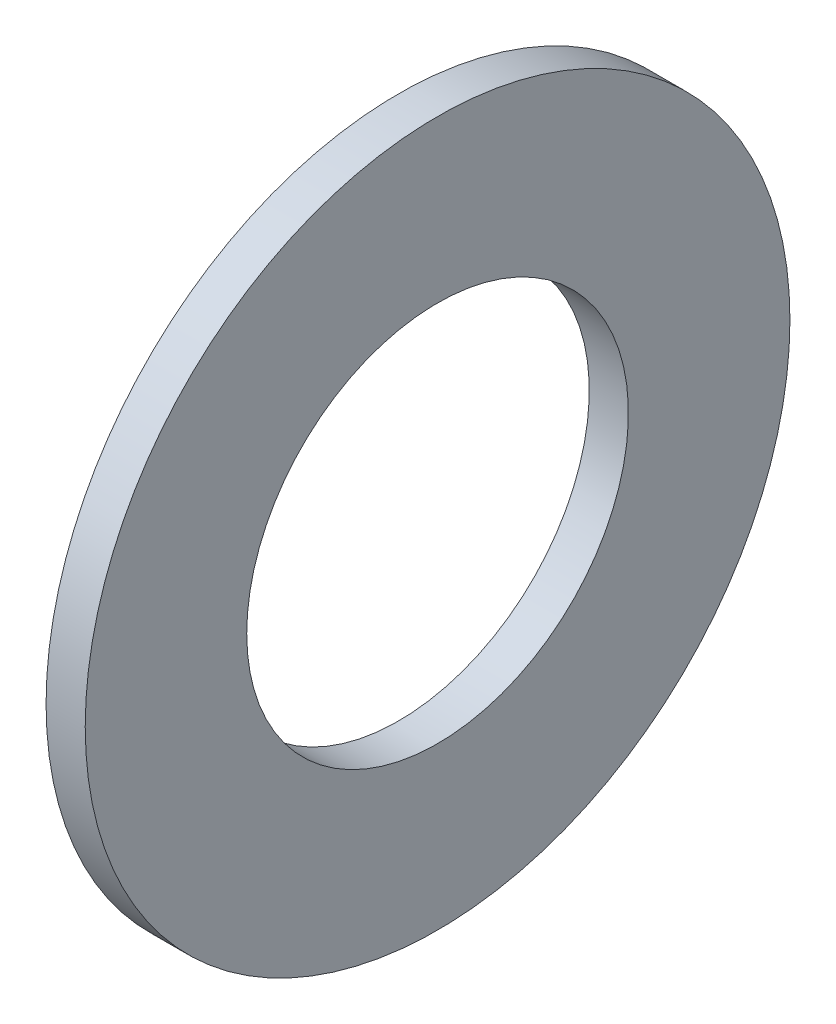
from build123d import *

# Parameters (mm, degrees)
SKETCH1_W = 4
SKETCH1_H = 16.5


with BuildPart() as part:
    # Sketch1 → Base-Revolve (revolve)
    with BuildSketch(Plane.XY, mode=Mode.PRIVATE) as base_revolve_sk:
        with Locations((-2, 27.75)):
            Rectangle(SKETCH1_W, SKETCH1_H)
    revolve(base_revolve_sk.sketch.rotate(Axis((-34.925, 0, 0), (1, 0, 0)), 90), axis=Axis((-34.925, 0, 0), (1, 0, 0)))


solid = part.part
